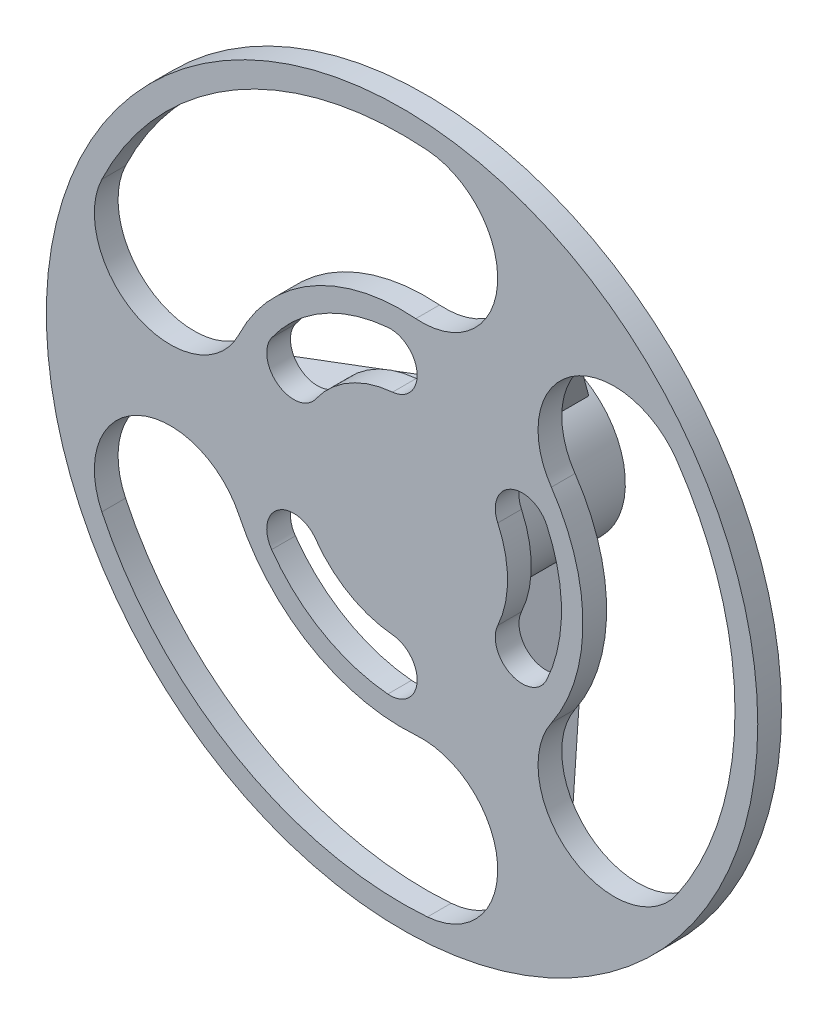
from build123d import *

# Parameters (mm, degrees)
ESQUISSE1_R                  = 45
BOSS_EXTRU_1_DEPTH           = 3
ESQUISSE2_R                  = 10.25
ESQUISSE2_R_2                = 7.25
BOSS_EXTRU_2_DEPTH           = 15
BOSS_EXTRU_3_DEPTH           = 1.5
R_P_TITION_CIRCULAIRE1_COUNT = 3
ENL_V_MAT_EXTRU_1_DEPTH      = 3
R_P_TITION_CIRCULAIRE2_COUNT = 3


with BuildPart() as part:
    # Esquisse1 → Boss.-Extru.1 (new body)
    with BuildSketch(Plane.XY):
        Circle(ESQUISSE1_R)
    extrude(amount=BOSS_EXTRU_1_DEPTH)

    # Esquisse2 → Boss.-Extru.2 (add)
    with BuildSketch(Plane(origin=(0, 0, 0), x_dir=(-1, 0, 0), z_dir=(0, 0, -1))):
        with Locations(Location((0, 0, 0), (0, 0, 180))):
            Circle(ESQUISSE2_R)
        Circle(ESQUISSE2_R_2, mode=Mode.SUBTRACT)
    extrude(amount=BOSS_EXTRU_2_DEPTH)

    # Esquisse3 → Boss.-Extru.3 (add, symmetric)
    with BuildSketch(Plane(origin=(0, 0, 0), x_dir=(1, 0, 0), z_dir=(0, 1, 0))):
        Polygon((-8.891263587, 15), (-33.970692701, 0), (-8.891263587, 0), align=None)
    boss_extru_3 = extrude(amount=BOSS_EXTRU_3_DEPTH, both=True)

    # R_p_tition circulaire1: Boss.-Extru.3 ×3 about axis
    r_p_tition_circulaire1_axis = Axis((0, 0, 0), (0, 0, 1))
    for i in range(1, R_P_TITION_CIRCULAIRE1_COUNT):
        add(boss_extru_3.rotate(r_p_tition_circulaire1_axis, i * 360 / R_P_TITION_CIRCULAIRE1_COUNT))

    # Esquisse4 → Enl_v. mat.-Extru.1 (cut)
    with BuildSketch(Plane(origin=(0, 0, 0), x_dir=(-1, 0, 0), z_dir=(0, 0, -1))):
        with BuildLine():
            ThreePointArc((37.976794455, 18.215627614), (21.059712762, 36.476492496), (-3.213200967, 41.996682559))
            ThreePointArc((-3.213200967, 41.996682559), (-12.070748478, 31.671444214), (-1.745510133, 22.813896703))
            ThreePointArc((-1.745510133, 22.813896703), (11.440287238, 19.81515875), (20.63016917, 9.895292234))
            ThreePointArc((20.63016917, 9.895292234), (33.463649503, 5.382147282), (37.976794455, 18.215627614))
        make_face()
        with BuildLine():
            ThreePointArc((16.494680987, 11.605632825), (10.084210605, 17.466365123), (1.80343236, 20.087629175))
            ThreePointArc((1.80343236, 20.087629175), (-1.897889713, 16.996152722), (1.193586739, 13.29483065))
            ThreePointArc((1.193586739, 13.29483065), (6.674151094, 11.559968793), (10.916867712, 7.681091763))
            ThreePointArc((10.916867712, 7.681091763), (15.668044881, 6.854455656), (16.494680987, 11.605632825))
        make_face()
    enl_v_mat_extru_1 = extrude(amount=-ENL_V_MAT_EXTRU_1_DEPTH, mode=Mode.SUBTRACT)

    # R_p_tition circulaire2: Enl_v. mat.-Extru.1 ×3 about axis
    r_p_tition_circulaire2_axis = Axis((0, 0, 0), (0, 0, 1))
    for i in range(1, R_P_TITION_CIRCULAIRE2_COUNT):
        add(enl_v_mat_extru_1.rotate(r_p_tition_circulaire2_axis, i * 360 / R_P_TITION_CIRCULAIRE2_COUNT), mode=Mode.SUBTRACT)


solid = part.part
